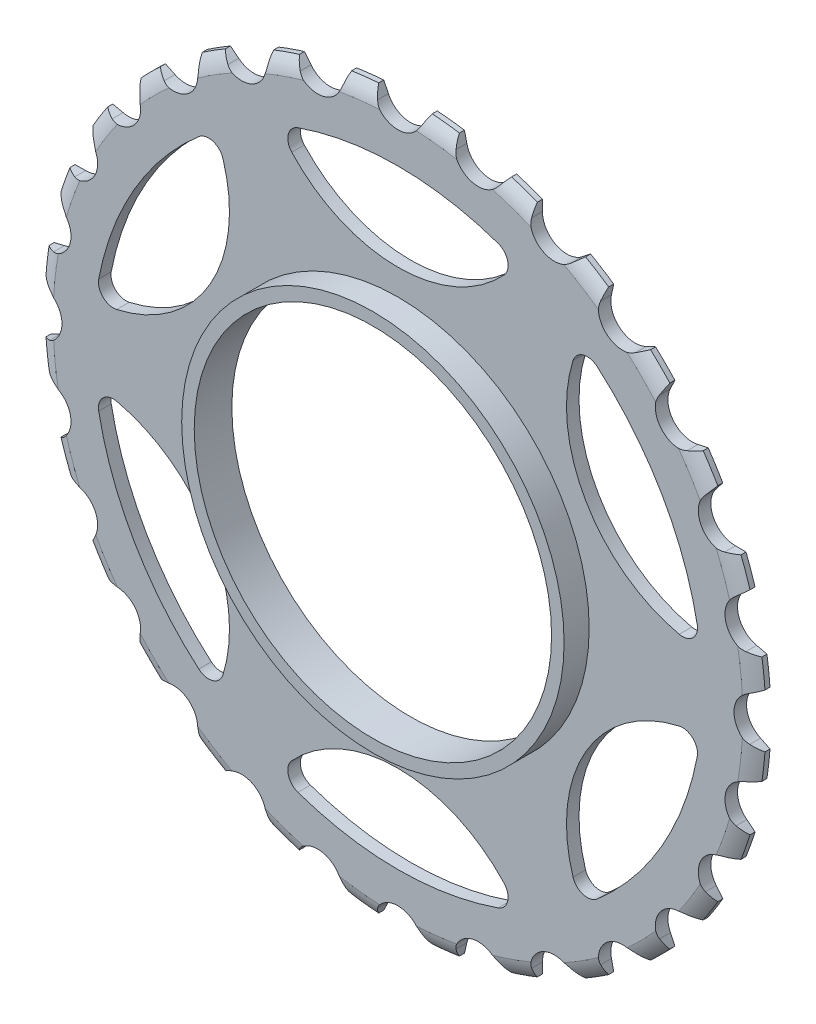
from build123d import *

# Parameters (mm, degrees)
EXTRUDE1_DEPTH      = 82.326133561
EXTRUDE2_DEPTH      = 82.326133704
CIRPATTERN1_COUNT   = 28
CIRPATTERN2_COUNT   = 6
SKETCH4_R           = 30.5
SKETCH4_R_2         = 28.5
EXTRUDE_THIN1_DEPTH = 4


with BuildPart() as part:
    # Sketch2 → Revolve1 (revolve)
    with BuildSketch(Plane(origin=(0, 0, 0), x_dir=(0, 0, -1), z_dir=(1, 0, 0)), mode=Mode.PRIVATE) as revolve1_sk:
        with BuildLine():
            Line((-1.2, 28.5), (0.8, 28.5))
            Line((0.8, 28.5), (0.8, 57.5))
            Line((0.8, 57.5), (0, 57.5))
            ThreePointArc((0, 57.5), (-0.760147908, 56.326870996), (-1.2, 55))
            Line((-1.2, 55), (-1.2, 28.5))
        make_face()
    revolve(revolve1_sk.sketch.rotate(Axis((0, 0, -80.9), (0, 0, 1)), 90), axis=Axis((0, 0, -80.9), (0, 0, 1)))

    # Sketch1 → Extrude1 (cut, symmetric)
    with BuildSketch(Plane.XY):
        with BuildLine():
            ThreePointArc((-5.782452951, 60.072337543), (-4.603798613, 57.978992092), (-3.525429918, 55.832263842))
            ThreePointArc((-3.525429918, 55.832263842), (0, 53.6), (3.525429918, 55.832263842))
            ThreePointArc((3.525429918, 55.832263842), (4.603798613, 57.978992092), (5.782452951, 60.072337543))
            ThreePointArc((5.782452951, 60.072337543), (0, 60.35), (-5.782452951, 60.072337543))
        make_face()
    extrude1 = extrude(amount=EXTRUDE1_DEPTH, both=True, mode=Mode.SUBTRACT)

    # Sketch3 → Extrude2 (cut, symmetric)
    with BuildSketch(Plane.XY):
        with BuildLine():
            ThreePointArc((-16.938584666, 42.022701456), (0, 34.6), (16.938584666, 42.022701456))
            ThreePointArc((16.938584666, 42.022701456), (17.5, 44.225346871), (15.965866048, 45.902626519))
            ThreePointArc((15.965866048, 45.902626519), (0, 48.6), (-15.965866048, 45.902626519))
            ThreePointArc((-15.965866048, 45.902626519), (-17.5, 44.225346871), (-16.938584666, 42.022701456))
        make_face()
    extrude2 = extrude(amount=EXTRUDE2_DEPTH, both=True, mode=Mode.SUBTRACT)

    # CirPattern1: Extrude1 ×28 about axis
    cirpattern1_axis = Axis((0, 0, 0), (0, 0, 1))
    for i in range(1, CIRPATTERN1_COUNT):
        add(extrude1.rotate(cirpattern1_axis, i * 360 / CIRPATTERN1_COUNT), mode=Mode.SUBTRACT)

    # CirPattern2: Extrude2 ×6 about axis
    cirpattern2_axis = Axis((0, 0, 0), (0, 0, 1))
    for i in range(1, CIRPATTERN2_COUNT):
        add(extrude2.rotate(cirpattern2_axis, i * 360 / CIRPATTERN2_COUNT), mode=Mode.SUBTRACT)

    # Sketch4 → Extrude-Thin1 (add)
    with BuildSketch(Plane.XY.offset(1.2)):
        Circle(SKETCH4_R)
        Circle(SKETCH4_R_2, mode=Mode.SUBTRACT)
    extrude(amount=EXTRUDE_THIN1_DEPTH)


solid = part.part
